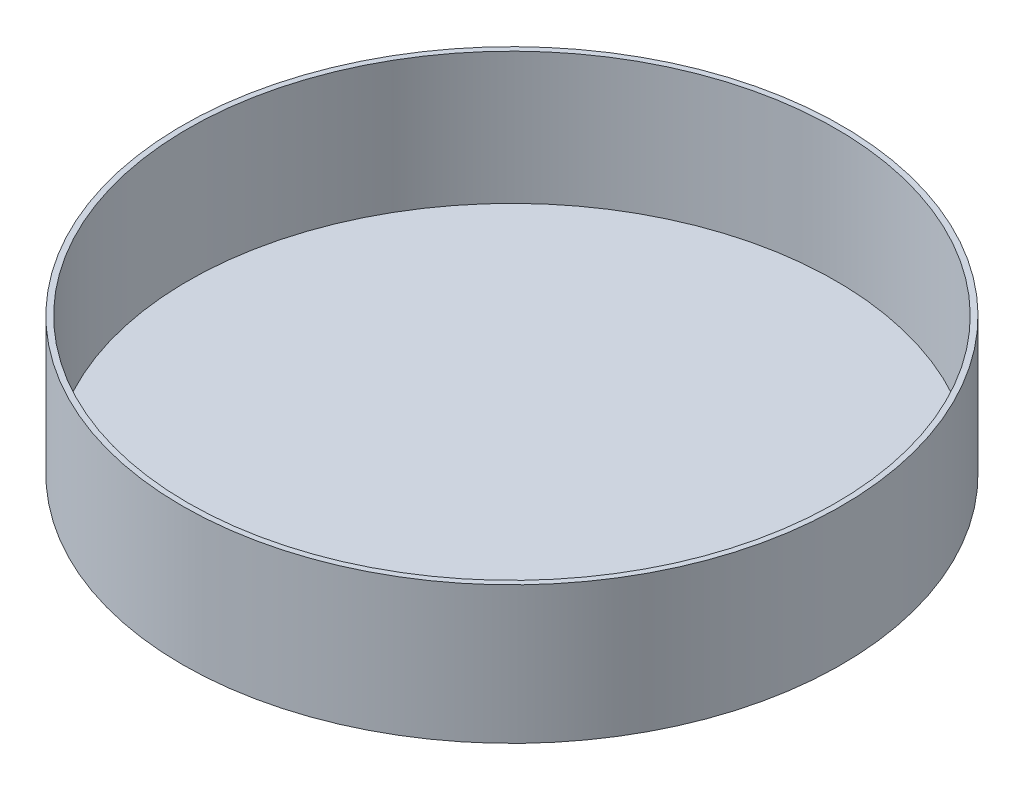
from build123d import *

# Parameters (mm, degrees)
CROQUIS1_R              = 60
SALIENTE_EXTRUIR1_DEPTH = 25
CROQUIS2_R              = 59
CORTAR_EXTRUIR1_DEPTH   = 24


with BuildPart() as part:
    # Croquis1 → Saliente-Extruir1 (new body)
    with BuildSketch(Plane(origin=(0, 0, 0), x_dir=(1, 0, 0), z_dir=(0, 1, 0))):
        with Locations(Location((0, 0, 0), (0, 0, 270))):
            Circle(CROQUIS1_R)
    extrude(amount=SALIENTE_EXTRUIR1_DEPTH)

    # Croquis2 → Cortar-Extruir1 (cut)
    with BuildSketch(Plane(origin=(0, 25, 0), x_dir=(1, 0, 0), z_dir=(0, 1, 0))):
        with Locations(Location((0, 0, 0), (0, 0, 270))):
            Circle(CROQUIS2_R)
    extrude(amount=-CORTAR_EXTRUIR1_DEPTH, mode=Mode.SUBTRACT)


solid = part.part
